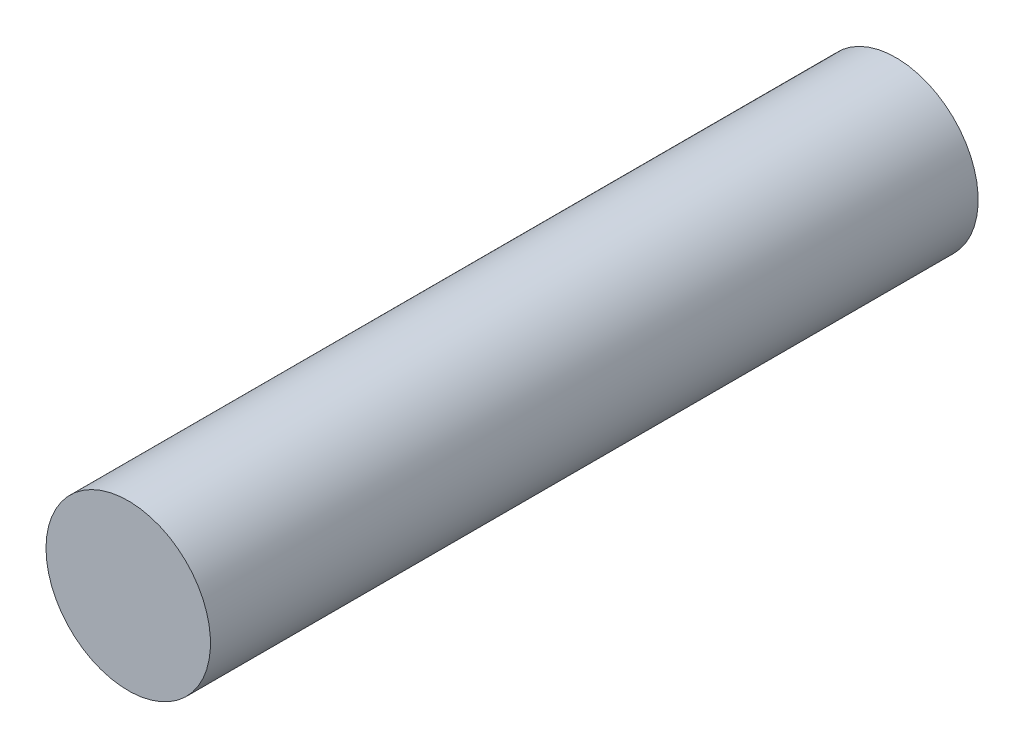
from build123d import *

# Parameters (mm, degrees)
SKIZZE1_R               = 2.25
LINEAR_AUSTRAGEN1_DEPTH = 21


with BuildPart() as part:
    # Skizze1 → Linear austragen1 (new body)
    with BuildSketch(Plane.XY):
        with Locations(Location((0, 0, 0), (0, 0, 180))):
            Circle(SKIZZE1_R)
    extrude(amount=LINEAR_AUSTRAGEN1_DEPTH)


solid = part.part
